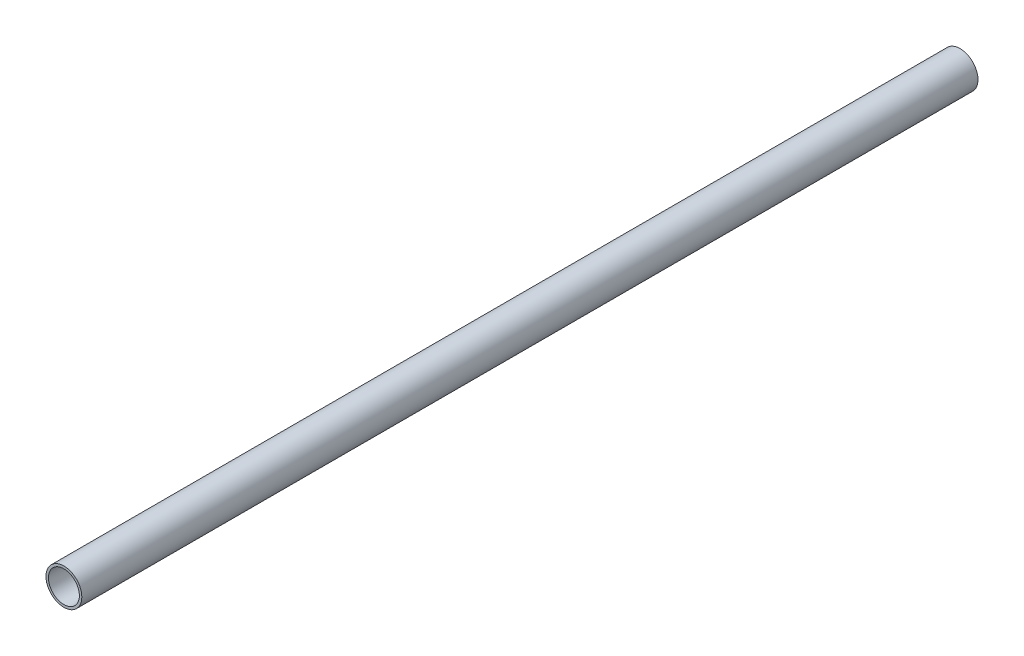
from build123d import *

# Parameters (mm, degrees)
CROQUIS1_R              = 11
CROQUIS1_R_2            = 9.5
SALIENTE_EXTRUIR1_DEPTH = 550


with BuildPart() as part:
    # Croquis1 → Saliente-Extruir1 (new body)
    with BuildSketch(Plane.XY):
        Circle(CROQUIS1_R)
        Circle(CROQUIS1_R_2, mode=Mode.SUBTRACT)
    extrude(amount=SALIENTE_EXTRUIR1_DEPTH)


solid = part.part
